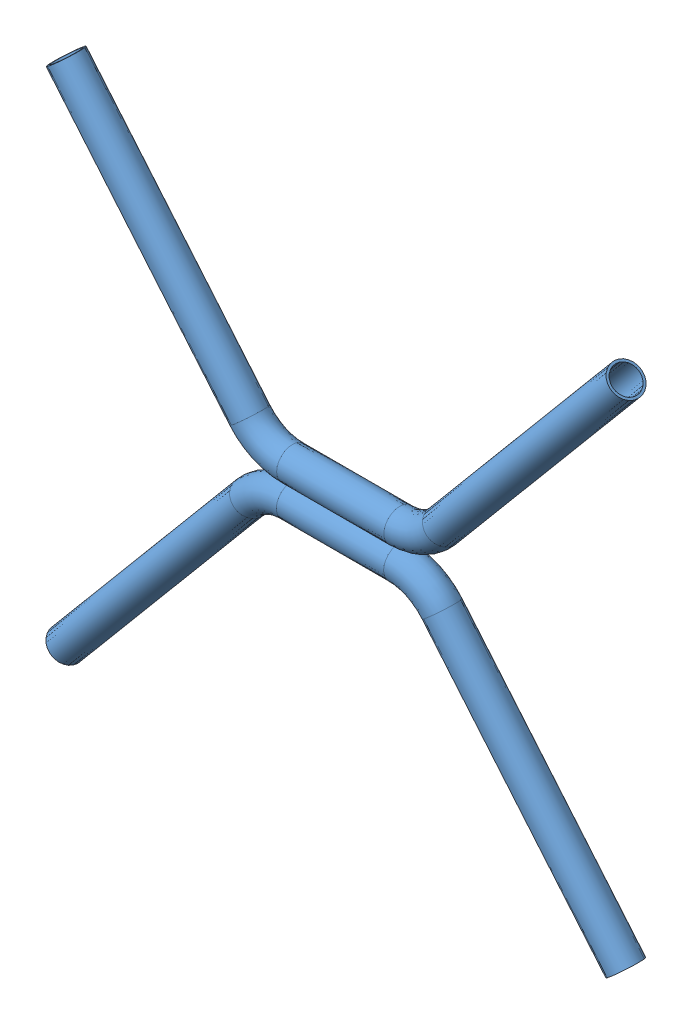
SolidWorks assembly zusammenbau.SLDASM, configuration Standard (file format 4100). Lengths in mm.
Overall size (367.22 332.86 20).
2 component instances, 1 part files, 4 mates.
Components (placement in the parent):
- standfuss-1: standfuss.SLDPRT [Standard] at (-159.8259 86.1658 0) size (367.05 166.43 20)
- standfuss-2: standfuss.SLDPRT [Standard] at (-159.6558 106.1658 0) x (-1 0 0) z (0 0 1) size (367.05 166.43 20)
Mates (geometry in assembly coordinates):
- Tangential19: tangent anti-aligned: cylinder of standfuss-1 through (-193.5051 86.1658 0) axis (1 0 0) radius 10; cylinder of standfuss-2 through (-125.9766 106.1658 0) axis (-1 0 0) radius 10
- Parallel17: parallel anti-aligned: plane of standfuss-1 through (-335.6908 -63.8342 0) normal (-0.642788 -0.766044 0); plane of standfuss-2 through (16.2091 256.1658 0) normal (0.642788 0.766044 0)
- Tangential20: tangent aligned: cylinder of standfuss-2 through (-99.165 118.6682 0) axis (0.642788 0.766044 0) radius 10; cylinder of standfuss-1 through (-99.3351 73.6634 0) axis (0.642788 -0.766044 0) radius 10
- Tangential21: tangent aligned: cylinder of standfuss-1 through (-220.3167 73.6634 0) axis (-0.642788 -0.766044 0) radius 10; cylinder of standfuss-2 through (-220.1466 118.6682 0) axis (-0.642788 0.766044 0) radius 10
